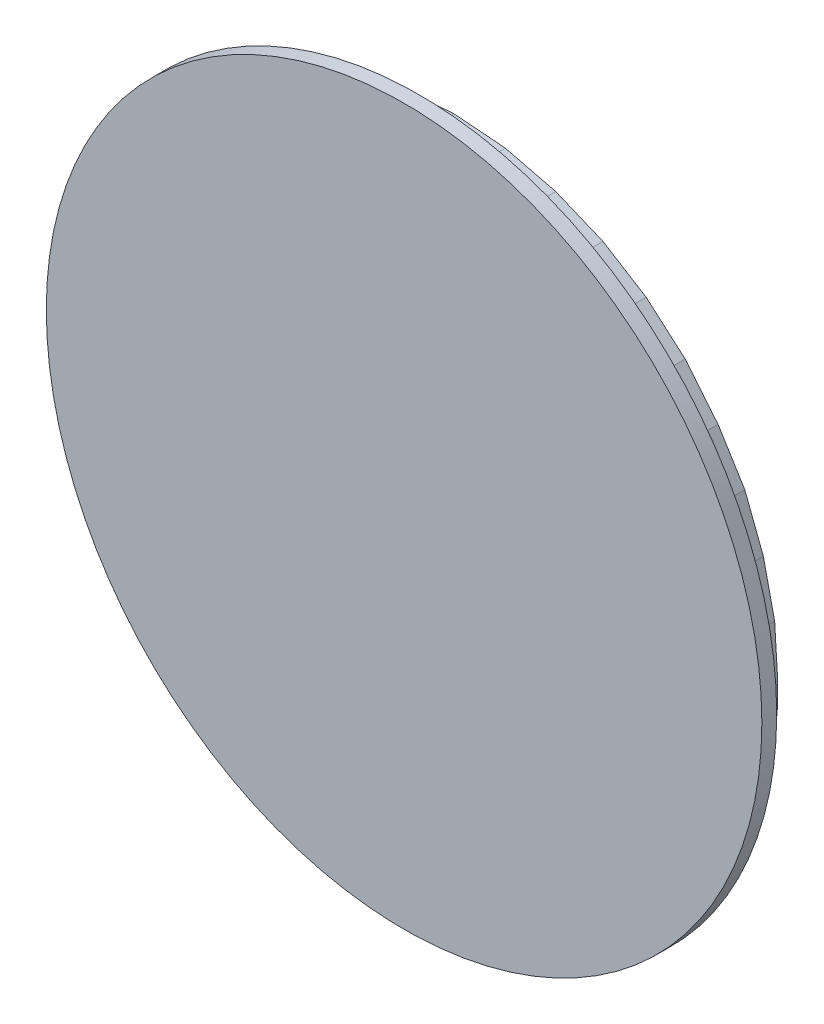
from build123d import *

# Parameters (mm, degrees)
COVER_OD53_TOTAL_TOP13_9_START    = 12.8
COVER_OD53_TOTAL_TOP13_9_SKETCH_R = 26.5
COVER_OD53_TOTAL_TOP13_9_DEPTH    = 1.1
LCD_REAR_REFERENCE_START          = 10.215
LCD_REAR_REFERENCE_DEPTH          = 2.585


with BuildPart() as part:
    # Cover_OD53_total_top13_9_Sketch → Cover_OD53_total_top13_9 (new body)
    with BuildSketch(Plane.XY.offset(COVER_OD53_TOTAL_TOP13_9_START)):
        Circle(COVER_OD53_TOTAL_TOP13_9_SKETCH_R)
    extrude(amount=COVER_OD53_TOTAL_TOP13_9_DEPTH)

    # LCD_rear_reference_Sketch → LCD_rear_reference (add)
    with BuildSketch(Plane.XY.offset(LCD_REAR_REFERENCE_START)):
        Polygon((5.10071, -25.88969), (-5.10071, -25.88969), (-7.91909, -24.97584), (-9.21482, -24.21375), (-9.21482, -22.76387), (-11.34587, -22.76387), (-13.4802, -21.16221), (-16.5255, -18.49493), (-19.03803, -15.36589), (-21.16907, -11.93653), (-22.69174, -8.19719), (-23.76055, -4.30929), (-23.98746, -1.94555), (-23.98746, -0.4214), (-23.75726, 3.31472), (-22.92193, 7.05407), (-21.47492, 10.63843), (-19.57079, 13.83851), (-17.1339, 16.81256), (-14.23988, 19.3313), (-10.96437, 21.314), (-7.46196, 22.76065), (-3.80497, 23.67773), (0, 23.98126), (3.80828, 23.67773), (7.5409, 22.76065), (11.04332, 21.314), (14.23989, 19.3313), (17.13391, 16.81256), (19.5708, 13.83851), (21.55058, 10.63843), (22.92195, 7.05407), (23.76055, 3.31472), (23.98747, -0.4214), (23.98747, -1.94555), (23.76055, -4.30929), (22.77066, -8.19719), (21.1691, -11.93653), (19.11369, -15.36589), (16.5255, -18.49493), (13.55584, -21.16221), (11.4215, -22.76387), (9.29046, -22.76387), (9.29046, -24.21375), (7.91909, -24.97584), align=None)
    extrude(amount=LCD_REAR_REFERENCE_DEPTH)


solid = part.part
